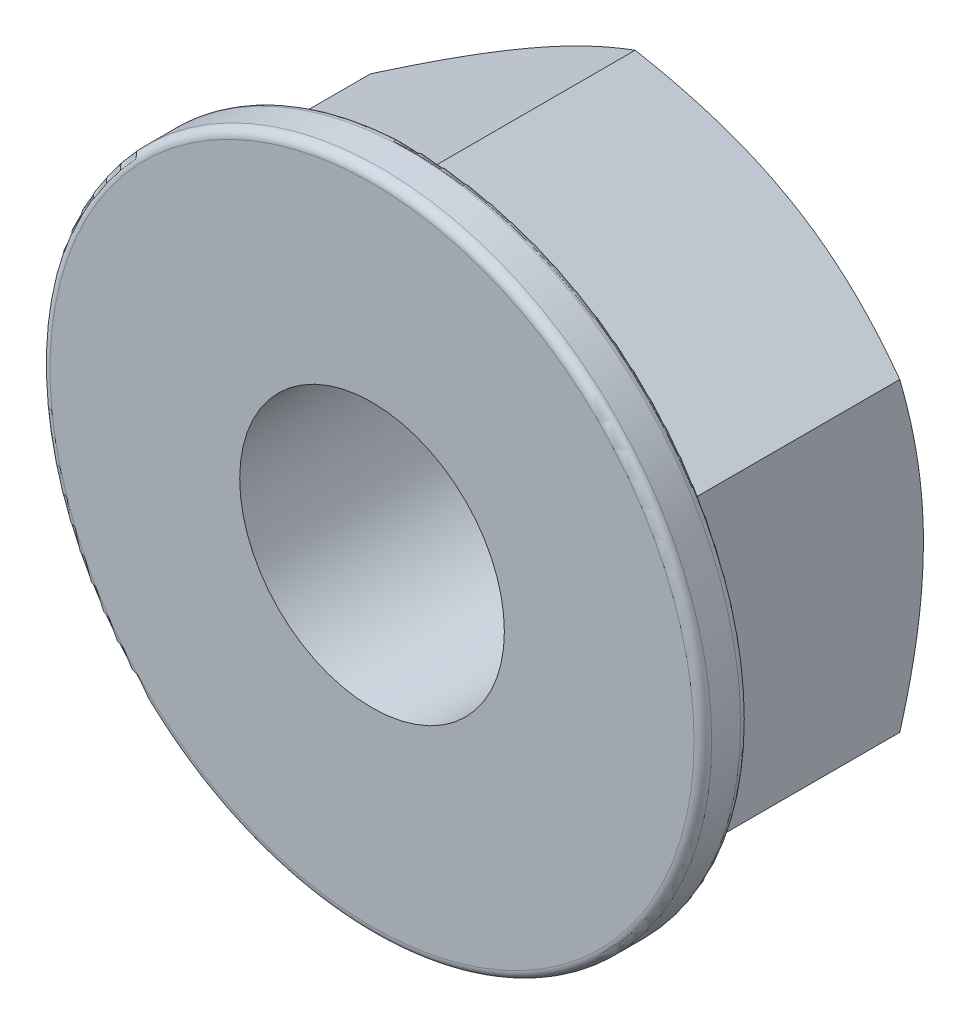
from build123d import *

# Parameters (mm, degrees)
BASE_EXTRUSION_DEPTH    = 3.25
ESQUISSE3_R             = 1.5
ENL_V_MAT_EXTRU_1_DEPTH = 6.618051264


with BuildPart() as part:
    # Esquisse1 → Base-Extrusion (new body)
    with BuildSketch(Plane.XY):
        Polygon((3, -1.732050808), (3, 1.732050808), (0, 3.464101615), (-3, 1.732050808), (-3, -1.732050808), (0, -3.464101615), align=None)
    extrude(amount=-BASE_EXTRUSION_DEPTH)

    # Esquisse2 → Enl_vement de mati_re-R_volution1 (revolve, cut)
    with BuildSketch(Plane(origin=(0, 0, 0), x_dir=(1, 0, 0), z_dir=(0, 1, 0))):
        Polygon((-3, 3.25), (-8.629165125, 3.25), (-8.629165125, 0), align=None)
    revolve(axis=Axis((0, 0, -3.25), (0, 0, 1)), mode=Mode.SUBTRACT)

    # Esquisse3 → Enl_v. mat.-Extru.1 (cut, through all)
    with BuildSketch(Plane.XY):
        Circle(ESQUISSE3_R)
    extrude(amount=-ENL_V_MAT_EXTRU_1_DEPTH, mode=Mode.SUBTRACT)

    # Esquisse4 → Boss.-R_vol.1 (revolve)
    with BuildSketch(Plane(origin=(0, 0, 0), x_dir=(1, 0, 0), z_dir=(0, 1, 0)), mode=Mode.PRIVATE) as boss_r_vol_1_sk:
        with BuildLine():
            Line((-3.681622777, 0.522792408), (-3, 0.75))
            Line((-3, 0.75), (-3, 0))
            Line((-3, 0), (-3.65, 0))
            ThreePointArc((-3.65, 0), (-3.720710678, 0.029289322), (-3.75, 0.1))
            Line((-3.75, 0.1), (-3.75, 0.427924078))
            ThreePointArc((-3.75, 0.427924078), (-3.731124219, 0.486395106), (-3.681622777, 0.522792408))
        make_face()
    revolve(boss_r_vol_1_sk.sketch.rotate(Axis((0, 0, 0), (0, 0, -1)), 180), axis=Axis((0, 0, 0), (0, 0, -1)))


solid = part.part
